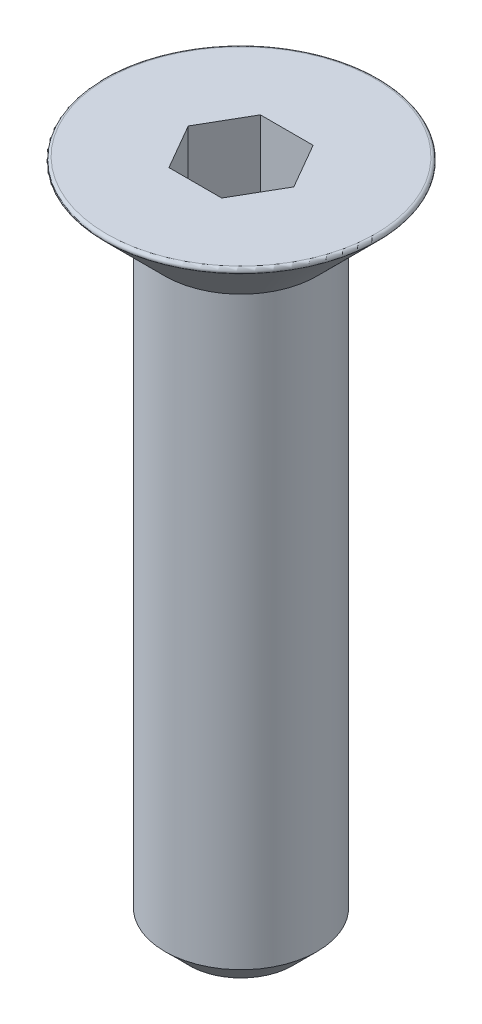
from build123d import *

# Parameters (mm, degrees)
CONG_1_R                = 0.1
CHANFREIN1_SIZE         = 0.8
ENL_V_MAT_EXTRU_1_DEPTH = 3


with BuildPart() as part:
    # Esquisse1 → R_volution1 (revolve)
    with BuildSketch(Plane.XY, mode=Mode.PRIVATE) as r_volution1_sk:
        Polygon((0, 0), (-4.65, 0), (-2.5, -2.15), (-2.5, -22.15), (0, -22.15), align=None)
    revolve(r_volution1_sk.sketch.rotate(Axis((0, 15.487971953, 0), (0, -1, 0)), 270), axis=Axis((0, 15.487971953, 0), (0, -1, 0)))

    # Cong_1
    cong_1_edges = [part.edges().sort_by_distance(p)[0] for p in [
        (0, 0, -4.65),
    ]]
    fillet(cong_1_edges, radius=CONG_1_R)

    # Chanfrein1
    chanfrein1_edges = [part.edges().sort_by_distance(p)[0] for p in [
        (0, -22.15, -2.5),
    ]]
    chamfer(chanfrein1_edges, length=CHANFREIN1_SIZE)

    # Esquisse2 → Enl_v. mat.-Extru.1 (cut)
    with BuildSketch(Plane(origin=(0, 0, 0), x_dir=(1, 0, 0), z_dir=(0, 1, 0))):
        Polygon((1.732050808, 0), (0.866025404, 1.5), (-0.866025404, 1.5), (-1.732050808, 0), (-0.866025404, -1.5), (0.866025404, -1.5), align=None)
    extrude(amount=-ENL_V_MAT_EXTRU_1_DEPTH, mode=Mode.SUBTRACT)


solid = part.part
